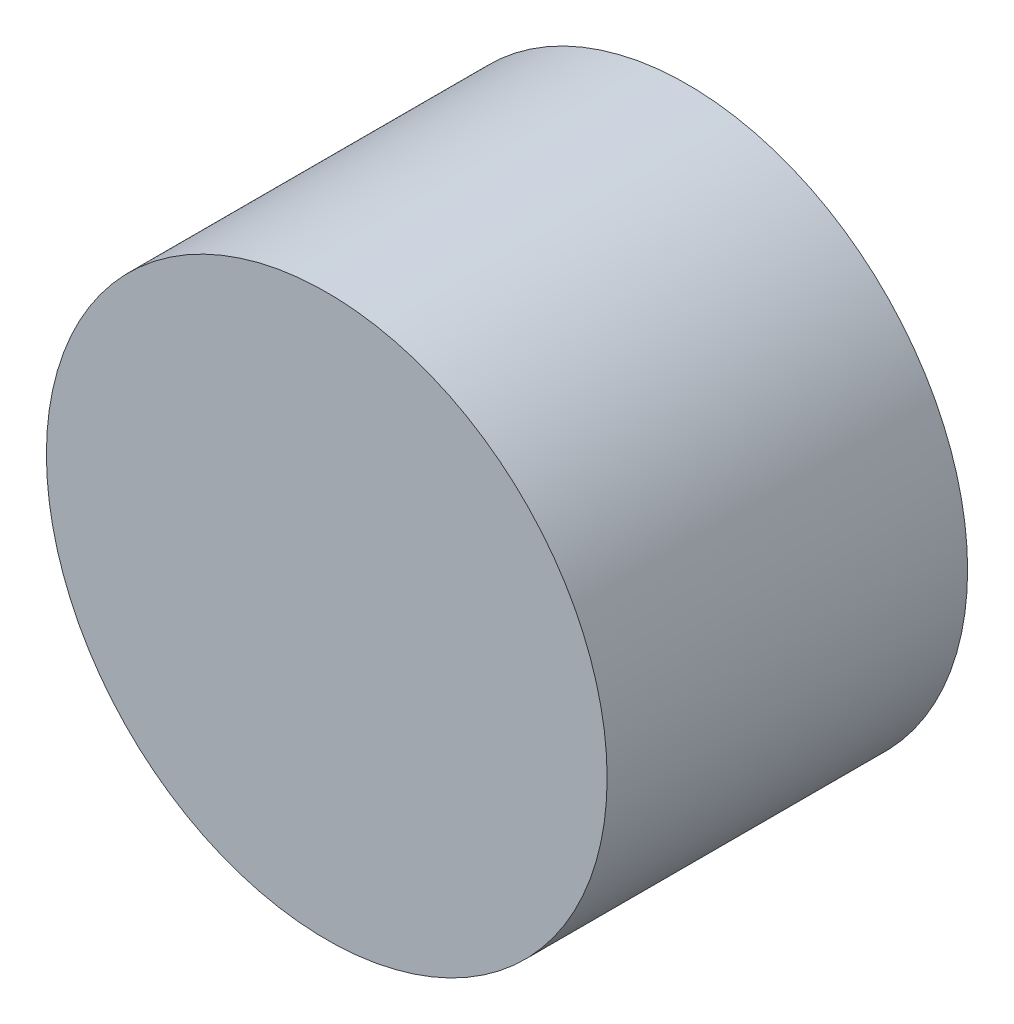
from build123d import *

# Parameters (mm, degrees)
ESQUISSE1_R      = 7
EXTRUSION1_DEPTH = 9


with BuildPart() as part:
    # Esquisse1 → Extrusion1 (new body)
    with BuildSketch(Plane.XY):
        Circle(ESQUISSE1_R)
    extrude(amount=EXTRUSION1_DEPTH)


solid = part.part
